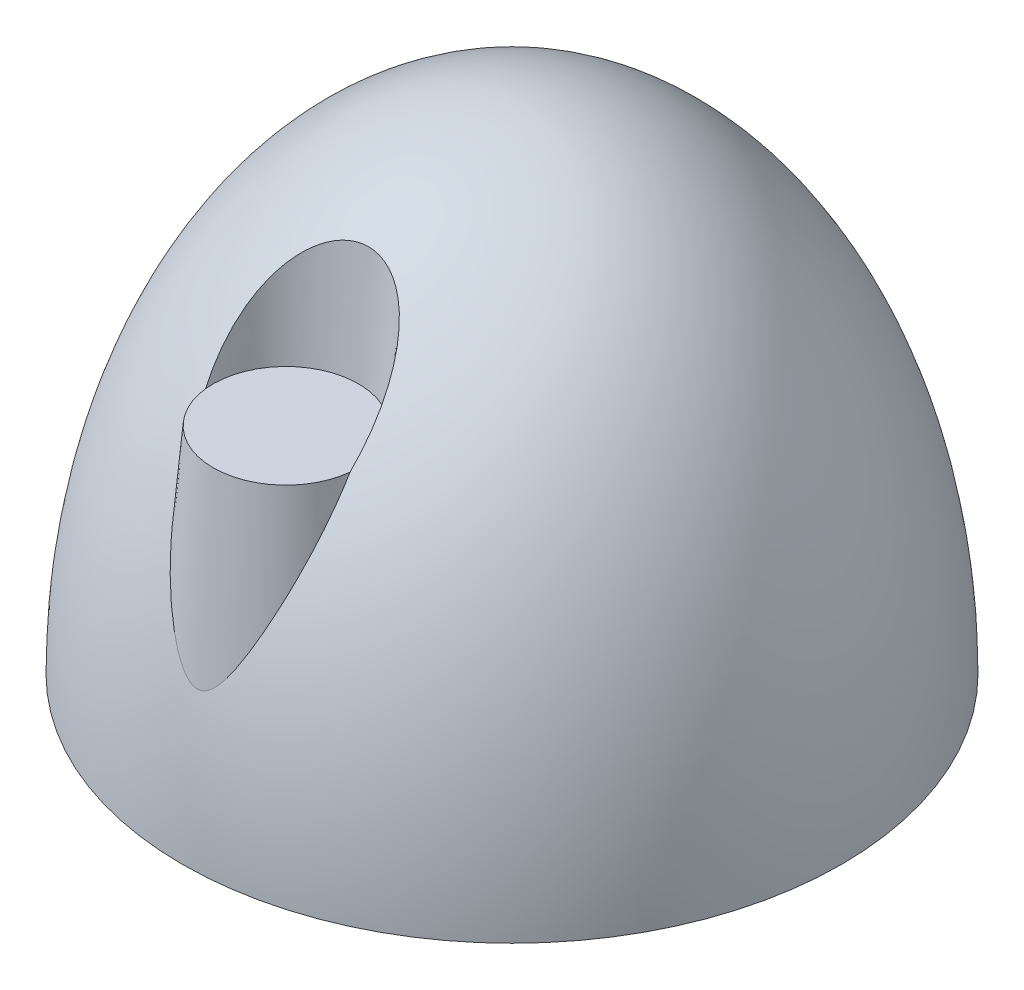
ISO-10303-21;
HEADER;
FILE_DESCRIPTION(('STEP AP214'),'2;1');
FILE_NAME('part.step','',(''),(''),'','','');
FILE_SCHEMA(('AUTOMOTIVE_DESIGN { 1 0 10303 214 1 1 1 1 }'));
ENDSEC;
DATA;
#1=APPLICATION_CONTEXT('core data for automotive mechanical design processes');
#2=APPLICATION_PROTOCOL_DEFINITION('international standard','automotive_design',2000,#1);
#3=PRODUCT_CONTEXT('',#1,'mechanical');
#4=PRODUCT('Part','Part','',(#3));
#5=PRODUCT_RELATED_PRODUCT_CATEGORY('part','',(#4));
#6=PRODUCT_DEFINITION_FORMATION('','',#4);
#7=PRODUCT_DEFINITION_CONTEXT('part definition',#1,'design');
#8=PRODUCT_DEFINITION('design','',#6,#7);
#9=PRODUCT_DEFINITION_SHAPE('','',#8);
#10=(LENGTH_UNIT() NAMED_UNIT(*) SI_UNIT(.MILLI.,.METRE.));
#11=(NAMED_UNIT(*) PLANE_ANGLE_UNIT() SI_UNIT($,.RADIAN.));
#12=(NAMED_UNIT(*) SI_UNIT($,.STERADIAN.) SOLID_ANGLE_UNIT());
#13=UNCERTAINTY_MEASURE_WITH_UNIT(LENGTH_MEASURE(1.E-05),#10,'distance_accuracy_value','');
#14=(GEOMETRIC_REPRESENTATION_CONTEXT(3) GLOBAL_UNCERTAINTY_ASSIGNED_CONTEXT((#13)) GLOBAL_UNIT_ASSIGNED_CONTEXT((#10,
#11,#12)) REPRESENTATION_CONTEXT('',''));
#15=CARTESIAN_POINT('',(0.,0.,0.));
#16=DIRECTION('',(0.,0.,1.));
#17=DIRECTION('',(1.,0.,0.));
#18=AXIS2_PLACEMENT_3D('',#15,#16,#17);
#19=CARTESIAN_POINT('',(0.,0.,0.));
#20=DIRECTION('',(-1.,0.,0.));
#21=DIRECTION('',(0.,1.,0.));
#22=AXIS2_PLACEMENT_3D('',#19,#20,#21);
#23=ELLIPSE('',#22,76.,51.);
#24=TRIMMED_CURVE('',#23,(PARAMETER_VALUE(3.14159265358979)),
(PARAMETER_VALUE(6.28318530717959)),.T.,.PARAMETER.);
#25=CARTESIAN_POINT('',(0.,0.,0.));
#26=DIRECTION('',(0.,1.,0.));
#27=AXIS1_PLACEMENT('',#25,#26);
#28=SURFACE_OF_REVOLUTION('',#24,#27);
#29=CARTESIAN_POINT('',(0.,76.,0.));
#30=VERTEX_POINT('',#29);
#31=VERTEX_LOOP('',#30);
#32=FACE_BOUND('',#31,.T.);
#33=CARTESIAN_POINT('',(0.,0.,0.));
#34=DIRECTION('',(0.,1.,0.));
#35=DIRECTION('',(0.,0.,1.));
#36=AXIS2_PLACEMENT_3D('',#33,#34,#35);
#37=CIRCLE('',#36,51.);
#38=CARTESIAN_POINT('',(0.,0.,51.));
#39=VERTEX_POINT('',#38);
#40=EDGE_CURVE('E48',#39,#39,#37,.T.);
#41=ORIENTED_EDGE('',*,*,#40,.T.);
#42=EDGE_LOOP('',(#41));
#43=FACE_BOUND('',#42,.T.);
#44=CARTESIAN_POINT('',(11.1805867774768,50.8,36.2477897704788));
#45=CARTESIAN_POINT('',(11.2390818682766,51.156553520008,36.0047262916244));
#46=CARTESIAN_POINT('',(11.2895969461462,51.5128453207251,35.7593363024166));
#47=CARTESIAN_POINT('',(11.3743735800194,52.225164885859,35.2637734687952));
#48=CARTESIAN_POINT('',(11.408600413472,52.5811904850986,35.0135915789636));
#49=CARTESIAN_POINT('',(11.460286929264,53.2921525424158,34.5090427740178));
#50=CARTESIAN_POINT('',(11.4777261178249,53.6470871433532,34.2546711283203));
#51=CARTESIAN_POINT('',(11.4952389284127,54.3550641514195,33.7423782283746));
#52=CARTESIAN_POINT('',(11.4953048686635,54.7081056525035,33.4844554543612));
#53=CARTESIAN_POINT('',(11.4773086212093,55.4158194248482,32.9625480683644));
#54=CARTESIAN_POINT('',(11.4590278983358,55.7704600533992,32.6985278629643));
#55=CARTESIAN_POINT('',(11.4032403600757,56.4762493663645,32.1682171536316));
#56=CARTESIAN_POINT('',(11.3657433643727,56.8273997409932,31.9019278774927));
#57=CARTESIAN_POINT('',(11.2706505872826,57.5254468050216,31.3678159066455));
#58=CARTESIAN_POINT('',(11.2130676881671,57.8723460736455,31.0999943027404));
#59=CARTESIAN_POINT('',(11.0767834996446,58.5611529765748,30.5635761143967));
#60=CARTESIAN_POINT('',(10.9980916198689,58.9030627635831,30.2949799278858));
#61=CARTESIAN_POINT('',(10.8404948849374,59.497682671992,29.8239352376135));
#62=CARTESIAN_POINT('',(10.7664001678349,59.7516537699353,29.6214613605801));
#63=CARTESIAN_POINT('',(10.604960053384,60.2557932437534,29.2170682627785));
#64=CARTESIAN_POINT('',(10.5176154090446,60.5059618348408,29.0151490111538));
#65=CARTESIAN_POINT('',(10.3290515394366,61.0019748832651,28.6124055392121));
#66=CARTESIAN_POINT('',(10.2278308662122,61.247818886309,28.4115814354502));
#67=CARTESIAN_POINT('',(10.0111808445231,61.7337909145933,28.0123030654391));
#68=CARTESIAN_POINT('',(9.89579439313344,61.9739336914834,27.8138435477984));
#69=CARTESIAN_POINT('',(9.64988306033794,62.4484917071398,27.4194718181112));
#70=CARTESIAN_POINT('',(9.51935906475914,62.6829072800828,27.2235594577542));
#71=CARTESIAN_POINT('',(9.24246275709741,63.1450896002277,26.8352221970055));
#72=CARTESIAN_POINT('',(9.0960939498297,63.3728578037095,26.642796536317));
#73=CARTESIAN_POINT('',(8.76468736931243,63.8526658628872,26.2353625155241));
#74=CARTESIAN_POINT('',(8.57711101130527,64.1035454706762,26.0210386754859));
#75=CARTESIAN_POINT('',(8.17910359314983,64.5935086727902,25.6001624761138));
#76=CARTESIAN_POINT('',(7.96867216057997,64.8325920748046,25.3936102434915));
#77=CARTESIAN_POINT('',(7.52413404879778,65.2964656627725,24.9907982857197));
#78=CARTESIAN_POINT('',(7.29005227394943,65.5212704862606,24.7945280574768));
#79=CARTESIAN_POINT('',(6.79713189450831,65.9541782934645,24.4147928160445));
#80=CARTESIAN_POINT('',(6.53829259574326,66.1622808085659,24.2313281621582));
#81=CARTESIAN_POINT('',(6.06942940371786,66.5045207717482,23.9283370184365));
#82=CARTESIAN_POINT('',(5.86529533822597,66.643372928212,23.80499968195));
#83=CARTESIAN_POINT('',(5.44382579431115,66.9090299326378,23.5683625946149));
#84=CARTESIAN_POINT('',(5.22649389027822,67.0358380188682,23.4550601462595));
#85=CARTESIAN_POINT('',(4.77912207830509,67.2757688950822,23.2401473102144));
#86=CARTESIAN_POINT('',(4.54909317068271,67.388903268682,23.1385270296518));
#87=CARTESIAN_POINT('',(4.07686672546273,67.5999416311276,22.9485590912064));
#88=CARTESIAN_POINT('',(3.8346710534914,67.6978479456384,22.8602094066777));
#89=CARTESIAN_POINT('',(3.37824229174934,67.8626725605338,22.7112095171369));
#90=CARTESIAN_POINT('',(3.16560141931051,67.9320427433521,22.6483882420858));
#91=CARTESIAN_POINT('',(2.73348681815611,68.0577950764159,22.5343677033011));
#92=CARTESIAN_POINT('',(2.51401437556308,68.1141796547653,22.4831662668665));
#93=CARTESIAN_POINT('',(2.06952375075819,68.2130732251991,22.3932804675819));
#94=CARTESIAN_POINT('',(1.84450768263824,68.2555874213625,22.3545914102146));
#95=CARTESIAN_POINT('',(1.39032905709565,68.3260468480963,22.2904325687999));
#96=CARTESIAN_POINT('',(1.16116645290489,68.3539919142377,22.2649629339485));
#97=CARTESIAN_POINT('',(0.699593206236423,68.3948752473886,22.2276907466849));
#98=CARTESIAN_POINT('',(0.46717409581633,68.4077615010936,22.2159355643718));
#99=CARTESIAN_POINT('',(0.00170479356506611,68.4181082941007,22.2064974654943));
#100=CARTESIAN_POINT('',(-0.231345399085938,68.4155688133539,22.2088145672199));
#101=CARTESIAN_POINT('',(-0.696211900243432,68.3951125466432,22.2274722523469));
#102=CARTESIAN_POINT('',(-0.928028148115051,68.3771950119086,22.2438135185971));
#103=CARTESIAN_POINT('',(-1.38860893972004,68.3263176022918,22.2901819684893));
#104=CARTESIAN_POINT('',(-1.61737352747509,68.2933579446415,22.320208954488));
#105=CARTESIAN_POINT('',(-2.05835097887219,68.2150938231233,22.3914359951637));
#106=CARTESIAN_POINT('',(-2.27080367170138,68.1705253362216,22.4319693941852));
#107=CARTESIAN_POINT('',(-2.69027076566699,68.0690860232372,22.5241109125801));
#108=CARTESIAN_POINT('',(-2.89728552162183,68.0122160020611,22.5757183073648));
#109=CARTESIAN_POINT('',(-3.30493000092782,67.8869406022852,22.6892320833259));
#110=CARTESIAN_POINT('',(-3.50555850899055,67.8185330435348,22.7511404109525));
#111=CARTESIAN_POINT('',(-3.89963673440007,67.6710297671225,22.8843999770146));
#112=CARTESIAN_POINT('',(-4.09308497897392,67.5919318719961,22.9557531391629));
#113=CARTESIAN_POINT('',(-4.54544479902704,67.3914551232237,23.1362492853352));
#114=CARTESIAN_POINT('',(-4.80078690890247,67.2655445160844,23.2493446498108));
#115=CARTESIAN_POINT('',(-5.29557453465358,66.9971118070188,23.4897013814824));
#116=CARTESIAN_POINT('',(-5.53501506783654,66.85458453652,23.6169671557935));
#117=CARTESIAN_POINT('',(-5.99791729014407,66.554817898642,23.8837074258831));
#118=CARTESIAN_POINT('',(-6.22135320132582,66.3975556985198,24.0232008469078));
#119=CARTESIAN_POINT('',(-6.65180553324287,66.0704356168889,24.3122661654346));
#120=CARTESIAN_POINT('',(-6.85882131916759,65.9005772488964,24.4618384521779));
#121=CARTESIAN_POINT('',(-7.3397647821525,65.476739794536,24.8335467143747));
#122=CARTESIAN_POINT('',(-7.60556930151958,65.2172339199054,25.059919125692));
#123=CARTESIAN_POINT('',(-8.10607855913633,64.6802671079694,25.5253895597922));
#124=CARTESIAN_POINT('',(-8.34077053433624,64.4027988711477,25.7644927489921));
#125=CARTESIAN_POINT('',(-8.78088060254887,63.8328510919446,26.2523560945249));
#126=CARTESIAN_POINT('',(-8.98626352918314,63.540354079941,26.5011274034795));
#127=CARTESIAN_POINT('',(-9.36913820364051,62.9432606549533,27.0053816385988));
#128=CARTESIAN_POINT('',(-9.54663031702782,62.6386644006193,27.2608644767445));
#129=CARTESIAN_POINT('',(-9.87592518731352,62.0184891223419,27.7772047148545));
#130=CARTESIAN_POINT('',(-10.0276468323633,61.7028790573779,28.0380762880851));
#131=CARTESIAN_POINT('',(-10.3063831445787,61.0631317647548,28.5627929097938));
#132=CARTESIAN_POINT('',(-10.4333870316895,60.7389908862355,28.8266392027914));
#133=CARTESIAN_POINT('',(-10.6640849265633,60.0836439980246,29.3558178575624));
#134=CARTESIAN_POINT('',(-10.7677747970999,59.7524367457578,29.6211504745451));
#135=CARTESIAN_POINT('',(-10.9533546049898,59.083350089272,30.1527296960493));
#136=CARTESIAN_POINT('',(-11.0351910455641,58.7454564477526,30.4189769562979));
#137=CARTESIAN_POINT('',(-11.177893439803,58.0648299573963,30.9507010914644));
#138=CARTESIAN_POINT('',(-11.238764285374,57.7220982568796,31.2161781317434));
#139=CARTESIAN_POINT('',(-11.3405960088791,57.0325728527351,31.7455812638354));
#140=CARTESIAN_POINT('',(-11.3815588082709,56.68577954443,32.0095075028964));
#141=CARTESIAN_POINT('',(-11.4404377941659,56.0336796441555,32.5013024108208));
#142=CARTESIAN_POINT('',(-11.4606416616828,55.728778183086,32.7294399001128));
#143=CARTESIAN_POINT('',(-11.487150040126,55.116843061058,33.1836209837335));
#144=CARTESIAN_POINT('',(-11.493455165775,54.8098094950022,33.4096646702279));
#145=CARTESIAN_POINT('',(-11.4926221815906,54.1939705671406,33.8593224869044));
#146=CARTESIAN_POINT('',(-11.4854834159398,53.8851651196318,34.0829364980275));
#147=CARTESIAN_POINT('',(-11.45826401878,53.2687782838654,34.5255241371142));
#148=CARTESIAN_POINT('',(-11.4382935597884,52.9612086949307,34.7445210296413));
#149=CARTESIAN_POINT('',(-11.3858356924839,52.3450508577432,35.179505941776));
#150=CARTESIAN_POINT('',(-11.3533492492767,52.0364626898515,35.3954941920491));
#151=CARTESIAN_POINT('',(-11.2761076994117,51.4186487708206,35.8241676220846));
#152=CARTESIAN_POINT('',(-11.2313558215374,51.1094232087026,36.036853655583));
#153=CARTESIAN_POINT('',(-11.1805867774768,50.8,36.2477897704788));
#154=B_SPLINE_CURVE_WITH_KNOTS('',3,(#44,#45,#46,#47,#48,#49,#50,#51,#52,#53,#54,#55,#56,#57,
#58,#59,#60,#61,#62,#63,#64,#65,#66,#67,#68,#69,#70,#71,#72,#73,#74,#75,#76,#77,#78,#79,#80,#81,
#82,#83,#84,#85,#86,#87,#88,#89,#90,#91,#92,#93,#94,#95,#96,#97,#98,#99,#100,#101,#102,#103,
#104,#105,#106,#107,#108,#109,#110,#111,#112,#113,#114,#115,#116,#117,#118,#119,#120,#121,#122,
#123,#124,#125,#126,#127,#128,#129,#130,#131,#132,#133,#134,#135,#136,#137,#138,#139,#140,#141,
#142,#143,#144,#145,#146,#147,#148,#149,#150,#151,#152,#153),.UNSPECIFIED.,.F.,.F.,(4,2,2,2,2,2,
2,2,2,2,2,2,2,2,2,2,2,2,2,2,2,2,2,2,2,2,2,2,2,2,2,2,2,2,2,2,2,2,2,2,2,2,2,2,2,2,2,2,2,2,2,2,2,2,
4),(0.,1.30634141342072,2.61545528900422,3.9261652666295,5.2374547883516,6.56455125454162,
7.89097023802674,9.21654007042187,10.5415199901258,11.5407036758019,12.5398305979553,
13.5390618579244,14.5353385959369,15.5315570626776,16.5275556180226,17.665332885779,
18.8031286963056,19.939738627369,21.0763804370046,21.903637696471,22.7306718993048,
23.5570004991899,24.383202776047,25.0794774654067,25.7756218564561,26.4715047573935,
27.1673955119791,27.8656828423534,28.5639710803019,29.2622933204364,29.9606054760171,
30.622387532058,31.2841262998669,31.9459902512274,32.6079892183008,33.525640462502,
34.4435779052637,35.3629620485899,36.2823817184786,37.5854396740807,38.8890305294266,
40.1941725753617,41.4992975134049,42.8084570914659,44.1181863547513,45.4281478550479,
46.7412873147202,48.0541201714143,49.3668262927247,50.5105790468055,51.6542812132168,
52.7980391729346,53.9321057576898,55.0660849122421,56.1997658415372),.UNSPECIFIED.);
#155=CARTESIAN_POINT('',(11.1805867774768,50.8,36.2477897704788));
#156=VERTEX_POINT('',#155);
#157=CARTESIAN_POINT('',(-11.1805867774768,50.8,36.2477897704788));
#158=VERTEX_POINT('',#157);
#159=EDGE_CURVE('E63',#156,#158,#154,.T.);
#160=ORIENTED_EDGE('',*,*,#159,.F.);
#161=CARTESIAN_POINT('',(-11.1805867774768,50.8,36.2477897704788));
#162=CARTESIAN_POINT('',(-11.1872480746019,50.4338313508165,36.4768215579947));
#163=CARTESIAN_POINT('',(-11.1873460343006,50.0664085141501,36.704000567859));
#164=CARTESIAN_POINT('',(-11.1750834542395,49.3294740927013,37.1543048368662));
#165=CARTESIAN_POINT('',(-11.1627274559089,48.959963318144,37.3774315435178));
#166=CARTESIAN_POINT('',(-11.1262304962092,48.2190352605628,37.8194324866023));
#167=CARTESIAN_POINT('',(-11.1020904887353,47.8476181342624,38.0383070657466));
#168=CARTESIAN_POINT('',(-11.0426062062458,47.1030574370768,38.471620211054));
#169=CARTESIAN_POINT('',(-11.0072609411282,46.729913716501,38.6860583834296));
#170=CARTESIAN_POINT('',(-10.9258904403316,45.9820906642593,39.1103176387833));
#171=CARTESIAN_POINT('',(-10.8798634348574,45.607411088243,39.3201379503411));
#172=CARTESIAN_POINT('',(-10.7775999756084,44.8567149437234,39.7349870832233));
#173=CARTESIAN_POINT('',(-10.7213617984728,44.4806981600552,39.9400150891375));
#174=CARTESIAN_POINT('',(-10.5964929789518,43.7114690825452,40.3537527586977));
#175=CARTESIAN_POINT('',(-10.5274351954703,43.3182091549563,40.5622448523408));
#176=CARTESIAN_POINT('',(-10.3791095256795,42.5306748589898,40.9736719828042));
#177=CARTESIAN_POINT('',(-10.2998408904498,42.1364004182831,41.1766066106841));
#178=CARTESIAN_POINT('',(-10.1314735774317,41.3470809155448,41.5767510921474));
#179=CARTESIAN_POINT('',(-10.0423755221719,40.9520359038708,41.7739613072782));
#180=CARTESIAN_POINT('',(-9.85468161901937,40.1614348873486,42.1624964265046));
#181=CARTESIAN_POINT('',(-9.75608808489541,39.7658790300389,42.3538227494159));
#182=CARTESIAN_POINT('',(-9.54968485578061,38.9745323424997,42.7304378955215));
#183=CARTESIAN_POINT('',(-9.44187937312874,38.5787417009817,42.9157294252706));
#184=CARTESIAN_POINT('',(-9.21727727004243,37.7872178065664,43.2801324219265));
#185=CARTESIAN_POINT('',(-9.10048688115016,37.3914847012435,43.4592480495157));
#186=CARTESIAN_POINT('',(-8.87000005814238,36.6393134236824,43.7938506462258));
#187=CARTESIAN_POINT('',(-8.75714753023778,36.2828744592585,43.9499180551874));
#188=CARTESIAN_POINT('',(-8.52423138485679,35.5702650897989,44.2569516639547));
#189=CARTESIAN_POINT('',(-8.40416951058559,35.2140946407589,44.4079190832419));
#190=CARTESIAN_POINT('',(-8.15671729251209,34.5020236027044,44.7047661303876));
#191=CARTESIAN_POINT('',(-8.02932449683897,34.1461231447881,44.850644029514));
#192=CARTESIAN_POINT('',(-7.76698456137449,33.434626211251,45.1373128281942));
#193=CARTESIAN_POINT('',(-7.63203049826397,33.0790303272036,45.2780988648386));
#194=CARTESIAN_POINT('',(-7.35420325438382,32.3682213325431,45.5545699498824));
#195=CARTESIAN_POINT('',(-7.2113180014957,32.0130096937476,45.6902466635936));
#196=CARTESIAN_POINT('',(-6.91707612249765,31.3031083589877,45.9564679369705));
#197=CARTESIAN_POINT('',(-6.76570094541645,30.9484216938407,46.0870001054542));
#198=CARTESIAN_POINT('',(-6.45692990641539,30.2472162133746,46.3401997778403));
#199=CARTESIAN_POINT('',(-6.29968980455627,29.900664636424,46.4629660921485));
#200=CARTESIAN_POINT('',(-5.97576876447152,29.2098858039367,46.7030068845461));
#201=CARTESIAN_POINT('',(-5.80908405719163,28.8656595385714,46.8202791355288));
#202=CARTESIAN_POINT('',(-5.4652340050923,28.1810323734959,47.0489347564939));
#203=CARTESIAN_POINT('',(-5.28808160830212,27.8406273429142,47.1603250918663));
#204=CARTESIAN_POINT('',(-5.01309836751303,27.3341206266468,47.322729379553));
#205=CARTESIAN_POINT('',(-4.9200116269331,27.1661668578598,47.3760230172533));
#206=CARTESIAN_POINT('',(-4.73034534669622,26.8317514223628,47.481043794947));
#207=CARTESIAN_POINT('',(-4.63376593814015,26.6652896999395,47.5327709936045));
#208=CARTESIAN_POINT('',(-4.43696828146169,26.3346491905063,47.6344466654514));
#209=CARTESIAN_POINT('',(-4.33676092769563,26.1704653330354,47.6843996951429));
#210=CARTESIAN_POINT('',(-4.13193105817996,25.8443598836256,47.7825799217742));
#211=CARTESIAN_POINT('',(-4.02730886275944,25.6824381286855,47.8308072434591));
#212=CARTESIAN_POINT('',(-3.81307843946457,25.3616118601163,47.9253601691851));
#213=CARTESIAN_POINT('',(-3.7034755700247,25.2027043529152,47.9716877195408));
#214=CARTESIAN_POINT('',(-3.47832648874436,24.888579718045,48.0623075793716));
#215=CARTESIAN_POINT('',(-3.36278140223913,24.7333618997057,48.1066002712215));
#216=CARTESIAN_POINT('',(-3.16075030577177,24.4741976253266,48.1797883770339));
#217=CARTESIAN_POINT('',(-3.07609343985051,24.3689934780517,48.2092754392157));
#218=CARTESIAN_POINT('',(-2.9028158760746,24.1614953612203,48.2670165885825));
#219=CARTESIAN_POINT('',(-2.81419430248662,24.0592020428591,48.2952704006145));
#220=CARTESIAN_POINT('',(-2.63234232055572,23.8582330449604,48.3503887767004));
#221=CARTESIAN_POINT('',(-2.53910825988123,23.7595603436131,48.3772522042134));
#222=CARTESIAN_POINT('',(-2.3473956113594,23.566977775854,48.4293257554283));
#223=CARTESIAN_POINT('',(-2.24891792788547,23.4730670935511,48.4545361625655));
#224=CARTESIAN_POINT('',(-2.06630668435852,23.3097432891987,48.4980979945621));
#225=CARTESIAN_POINT('',(-1.9832720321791,23.23920207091,48.5168090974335));
#226=CARTESIAN_POINT('',(-1.81288948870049,23.1031403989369,48.5527235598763));
#227=CARTESIAN_POINT('',(-1.72554297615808,23.0376183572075,48.5699273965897));
#228=CARTESIAN_POINT('',(-1.54622069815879,22.9130169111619,48.6024975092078));
#229=CARTESIAN_POINT('',(-1.45425322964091,22.8539265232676,48.6178669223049));
#230=CARTESIAN_POINT('',(-1.26533771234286,22.7438289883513,48.6463916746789));
#231=CARTESIAN_POINT('',(-1.16839312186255,22.6928163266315,48.6595485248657));
#232=CARTESIAN_POINT('',(-0.945011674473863,22.5897116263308,48.6860566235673));
#233=CARTESIAN_POINT('',(-0.817148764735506,22.5403911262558,48.6986725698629));
#234=CARTESIAN_POINT('',(-0.620636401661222,22.4816949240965,48.7136513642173));
#235=CARTESIAN_POINT('',(-0.554371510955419,22.4646804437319,48.7179858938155));
#236=CARTESIAN_POINT('',(-0.420591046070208,22.4362223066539,48.7252292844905));
#237=CARTESIAN_POINT('',(-0.35307608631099,22.4247759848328,48.7281388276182));
#238=CARTESIAN_POINT('',(-0.216709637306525,22.4077732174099,48.7324589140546));
#239=CARTESIAN_POINT('',(-0.147851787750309,22.4022643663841,48.7338573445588));
#240=CARTESIAN_POINT('',(-0.00990589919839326,22.3975030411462,48.7350660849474));
#241=CARTESIAN_POINT('',(0.0591821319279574,22.398250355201,48.7348764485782));
#242=CARTESIAN_POINT('',(0.197030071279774,22.4059758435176,48.7329149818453));
#243=CARTESIAN_POINT('',(0.265789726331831,22.4129582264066,48.7311420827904));
#244=CARTESIAN_POINT('',(0.402376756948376,22.4329014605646,48.7260731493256));
#245=CARTESIAN_POINT('',(0.470204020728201,22.4458630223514,48.7227769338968));
#246=CARTESIAN_POINT('',(0.615093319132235,22.4798218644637,48.7141285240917));
#247=CARTESIAN_POINT('',(0.691918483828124,22.5017660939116,48.7085335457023));
#248=CARTESIAN_POINT('',(0.843252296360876,22.5522532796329,48.6956325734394));
#249=CARTESIAN_POINT('',(0.917759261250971,22.5808009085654,48.6883253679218));
#250=CARTESIAN_POINT('',(1.06426627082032,22.6436234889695,48.6722023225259));
#251=CARTESIAN_POINT('',(1.1362622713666,22.6779072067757,48.6633841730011));
#252=CARTESIAN_POINT('',(1.27753399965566,22.7512959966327,48.6444511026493));
#253=CARTESIAN_POINT('',(1.34681020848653,22.7904002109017,48.6343364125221));
#254=CARTESIAN_POINT('',(1.53390719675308,22.9036487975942,48.6049465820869));
#255=CARTESIAN_POINT('',(1.64900030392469,22.9820053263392,48.5845089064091));
#256=CARTESIAN_POINT('',(1.87183308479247,23.1478964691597,48.5409514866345));
#257=CARTESIAN_POINT('',(1.97956636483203,23.2354388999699,48.5178294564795));
#258=CARTESIAN_POINT('',(2.18884827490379,23.4175820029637,48.469381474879));
#259=CARTESIAN_POINT('',(2.29037913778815,23.5122013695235,48.444049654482));
#260=CARTESIAN_POINT('',(2.4877860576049,23.7065828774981,48.3916266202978));
#261=CARTESIAN_POINT('',(2.5836642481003,23.8063430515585,48.3645360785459));
#262=CARTESIAN_POINT('',(2.7812074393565,24.0214228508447,48.3056901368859));
#263=CARTESIAN_POINT('',(2.88229304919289,24.1372228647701,48.2737543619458));
#264=CARTESIAN_POINT('',(3.07937954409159,24.3726508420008,48.2082729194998));
#265=CARTESIAN_POINT('',(3.17537931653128,24.4922796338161,48.1747269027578));
#266=CARTESIAN_POINT('',(3.36314891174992,24.7347349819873,48.1061534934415));
#267=CARTESIAN_POINT('',(3.45491110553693,24.8575667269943,48.0711236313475));
#268=CARTESIAN_POINT('',(3.63460441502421,25.1056387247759,47.999766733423));
#269=CARTESIAN_POINT('',(3.72253517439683,25.2308792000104,47.9634395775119));
#270=CARTESIAN_POINT('',(3.9814383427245,25.6097191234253,47.8526053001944));
#271=CARTESIAN_POINT('',(4.14737256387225,25.866240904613,47.7763007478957));
#272=CARTESIAN_POINT('',(4.46944543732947,26.3860332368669,47.619005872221));
#273=CARTESIAN_POINT('',(4.62552314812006,26.6493338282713,47.5379914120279));
#274=CARTESIAN_POINT('',(4.92853559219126,27.1794546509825,47.3720959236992));
#275=CARTESIAN_POINT('',(5.0754816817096,27.4462699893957,47.2872199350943));
#276=CARTESIAN_POINT('',(5.3617045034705,27.982656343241,47.1137495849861));
#277=CARTESIAN_POINT('',(5.50098363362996,28.2522264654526,47.0251564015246));
#278=CARTESIAN_POINT('',(5.79237890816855,28.832382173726,46.8313939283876));
#279=CARTESIAN_POINT('',(5.94346645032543,29.1432988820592,46.7256711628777));
#280=CARTESIAN_POINT('',(6.23789807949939,29.7672264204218,46.5096780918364));
#281=CARTESIAN_POINT('',(6.38124168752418,30.0802373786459,46.399407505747));
#282=CARTESIAN_POINT('',(6.66101334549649,30.7081415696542,46.1743245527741));
#283=CARTESIAN_POINT('',(6.79743406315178,31.023036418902,46.0595075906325));
#284=CARTESIAN_POINT('',(7.06368473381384,31.6540011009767,45.8255303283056));
#285=CARTESIAN_POINT('',(7.19351445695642,31.9700709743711,45.7063698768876));
#286=CARTESIAN_POINT('',(7.57387738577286,32.9201369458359,45.3422738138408));
#287=CARTESIAN_POINT('',(7.81504650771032,33.5554515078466,45.0909161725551));
#288=CARTESIAN_POINT('',(8.2739633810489,34.8279230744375,44.5715498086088));
#289=CARTESIAN_POINT('',(8.49170432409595,35.465080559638,44.3035362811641));
#290=CARTESIAN_POINT('',(8.90331584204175,36.7375362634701,43.7523585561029));
#291=CARTESIAN_POINT('',(9.09727106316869,37.3728327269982,43.4692535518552));
#292=CARTESIAN_POINT('',(9.46180790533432,38.6425137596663,42.8876225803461));
#293=CARTESIAN_POINT('',(9.63240542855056,39.2768986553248,42.589107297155));
#294=CARTESIAN_POINT('',(9.94948166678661,40.5440283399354,41.9770974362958));
#295=CARTESIAN_POINT('',(10.0959733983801,41.176773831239,41.6636110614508));
#296=CARTESIAN_POINT('',(10.3636874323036,42.4400290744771,41.0221012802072));
#297=CARTESIAN_POINT('',(10.4849172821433,43.0705394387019,40.6940822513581));
#298=CARTESIAN_POINT('',(10.6611898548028,44.0990557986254,40.1463294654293));
#299=CARTESIAN_POINT('',(10.72424045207,44.4979304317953,39.9307694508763));
#300=CARTESIAN_POINT('',(10.8390281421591,45.2942983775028,39.4941818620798));
#301=CARTESIAN_POINT('',(10.8907658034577,45.6917917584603,39.2731545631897));
#302=CARTESIAN_POINT('',(10.982377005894,46.4851387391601,38.8258458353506));
#303=CARTESIAN_POINT('',(11.0222516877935,46.8809924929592,38.5995649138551));
#304=CARTESIAN_POINT('',(11.0895083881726,47.6706416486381,38.1420722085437));
#305=CARTESIAN_POINT('',(11.1168967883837,48.0644380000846,37.9108630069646));
#306=CARTESIAN_POINT('',(11.1585305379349,48.8499300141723,37.4436373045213));
#307=CARTESIAN_POINT('',(11.1727746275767,49.2416254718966,37.2076203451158));
#308=CARTESIAN_POINT('',(11.1873328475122,50.0226831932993,36.7310271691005));
#309=CARTESIAN_POINT('',(11.1876419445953,50.4120445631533,36.4904493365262));
#310=CARTESIAN_POINT('',(11.1805867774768,50.8,36.2477897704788));
#311=B_SPLINE_CURVE_WITH_KNOTS('',3,(#161,#162,#163,#164,#165,#166,#167,#168,#169,#170,#171,
#172,#173,#174,#175,#176,#177,#178,#179,#180,#181,#182,#183,#184,#185,#186,#187,#188,#189,#190,
#191,#192,#193,#194,#195,#196,#197,#198,#199,#200,#201,#202,#203,#204,#205,#206,#207,#208,#209,
#210,#211,#212,#213,#214,#215,#216,#217,#218,#219,#220,#221,#222,#223,#224,#225,#226,#227,#228,
#229,#230,#231,#232,#233,#234,#235,#236,#237,#238,#239,#240,#241,#242,#243,#244,#245,#246,#247,
#248,#249,#250,#251,#252,#253,#254,#255,#256,#257,#258,#259,#260,#261,#262,#263,#264,#265,#266,
#267,#268,#269,#270,#271,#272,#273,#274,#275,#276,#277,#278,#279,#280,#281,#282,#283,#284,#285,
#286,#287,#288,#289,#290,#291,#292,#293,#294,#295,#296,#297,#298,#299,#300,#301,#302,#303,#304,
#305,#306,#307,#308,#309,#310),.UNSPECIFIED.,.F.,.F.,(4,2,2,2,2,2,2,2,2,2,2,2,2,2,2,2,2,2,2,2,2,
2,2,2,2,2,2,2,2,2,2,2,2,2,2,2,2,2,2,2,2,2,2,2,2,2,2,2,2,2,2,2,2,2,2,2,2,2,2,2,2,2,2,2,2,2,2,2,2,
2,2,2,2,2,4),(0.,1.29575969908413,2.59104706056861,3.88622958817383,5.18152659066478,
6.47703835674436,7.7727689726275,9.1239163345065,10.4751628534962,11.8263238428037,
13.1771564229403,14.5273745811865,15.876664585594,17.092001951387,18.3070466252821,
19.5225000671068,20.7390852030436,21.9575757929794,23.178841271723,24.378300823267,
25.5782424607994,26.7767296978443,27.3745457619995,27.9723394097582,28.568466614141,
29.1645506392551,29.7600078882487,30.3553527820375,30.7699314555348,31.1846021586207,
31.5996066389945,32.0145397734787,32.3460141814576,32.6773832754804,33.0081772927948,
33.3387444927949,33.7499397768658,33.95538440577,34.160730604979,34.3677108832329,
34.5746841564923,34.7817972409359,34.9889349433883,35.2288465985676,35.4689285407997,
35.7093808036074,35.9497903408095,36.3712347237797,36.7930406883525,37.2160031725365,
37.6388049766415,38.10962301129,38.5805436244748,39.0522813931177,39.5240629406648,
40.4683826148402,41.4180619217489,42.3665355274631,43.3147107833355,44.3990414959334,
45.4834392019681,46.5689624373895,47.654523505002,49.827500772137,52.001107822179,
54.1667402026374,56.3308907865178,58.4938689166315,60.6561998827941,62.0293207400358,
63.4023725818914,64.775292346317,66.1475096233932,67.5198583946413,68.8927028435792),.UNSPECIFIED.);
#312=EDGE_CURVE('E11',#158,#156,#311,.T.);
#313=ORIENTED_EDGE('',*,*,#312,.F.);
#314=EDGE_LOOP('',(#160,#313));
#315=FACE_BOUND('',#314,.T.);
#316=ADVANCED_FACE('F34',(#32,#43,#315),#28,.T.);
#317=CARTESIAN_POINT('',(0.,0.,0.));
#318=DIRECTION('',(0.,1.,0.));
#319=DIRECTION('',(0.,0.,1.));
#320=AXIS2_PLACEMENT_3D('',#317,#318,#319);
#321=PLANE('',#320);
#322=ORIENTED_EDGE('',*,*,#40,.F.);
#323=EDGE_LOOP('',(#322));
#324=FACE_BOUND('',#323,.T.);
#325=ADVANCED_FACE('F74',(#324),#321,.F.);
#326=CARTESIAN_POINT('',(0.,50.8,35.));
#327=DIRECTION('',(0.,-1.,0.));
#328=DIRECTION('',(0.,0.,1.));
#329=AXIS2_PLACEMENT_3D('',#326,#327,#328);
#330=CONICAL_SURFACE('',#329,11.25,0.0872664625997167);
#331=CARTESIAN_POINT('',(0.,50.8,35.));
#332=DIRECTION('',(0.,1.,0.));
#333=DIRECTION('',(0.,0.,1.));
#334=AXIS2_PLACEMENT_3D('',#331,#332,#333);
#335=CIRCLE('',#334,11.25);
#336=EDGE_CURVE('E68',#158,#156,#335,.T.);
#337=ORIENTED_EDGE('',*,*,#336,.F.);
#338=ORIENTED_EDGE('',*,*,#312,.T.);
#339=EDGE_LOOP('',(#337,#338));
#340=FACE_BOUND('',#339,.T.);
#341=ADVANCED_FACE('F36',(#340),#330,.T.);
#342=CARTESIAN_POINT('',(0.,50.8,35.));
#343=DIRECTION('',(0.,1.,0.));
#344=DIRECTION('',(0.,0.,1.));
#345=AXIS2_PLACEMENT_3D('',#342,#343,#344);
#346=PLANE('',#345);
#347=ORIENTED_EDGE('',*,*,#336,.T.);
#348=CARTESIAN_POINT('',(0.,50.8,35.));
#349=DIRECTION('',(0.,1.,0.));
#350=DIRECTION('',(0.,0.,1.));
#351=AXIS2_PLACEMENT_3D('',#348,#349,#350);
#352=CIRCLE('',#351,11.25);
#353=EDGE_CURVE('E57',#156,#158,#352,.T.);
#354=ORIENTED_EDGE('',*,*,#353,.T.);
#355=EDGE_LOOP('',(#347,#354));
#356=FACE_BOUND('',#355,.T.);
#357=ADVANCED_FACE('F70',(#356),#346,.T.);
#358=CARTESIAN_POINT('',(0.,50.8,35.));
#359=DIRECTION('',(0.,1.,0.));
#360=DIRECTION('',(0.,0.,1.));
#361=AXIS2_PLACEMENT_3D('',#358,#359,#360);
#362=CONICAL_SURFACE('',#361,11.25,0.0872664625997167);
#363=ORIENTED_EDGE('',*,*,#159,.T.);
#364=ORIENTED_EDGE('',*,*,#353,.F.);
#365=EDGE_LOOP('',(#363,#364));
#366=FACE_BOUND('',#365,.T.);
#367=ADVANCED_FACE('F62',(#366),#362,.F.);
#368=CLOSED_SHELL('',(#316,#325,#341,#357,#367));
#369=MANIFOLD_SOLID_BREP('B2',#368);
#370=ADVANCED_BREP_SHAPE_REPRESENTATION('',(#18,#369),#14);
#371=SHAPE_DEFINITION_REPRESENTATION(#9,#370);
ENDSEC;
END-ISO-10303-21;
